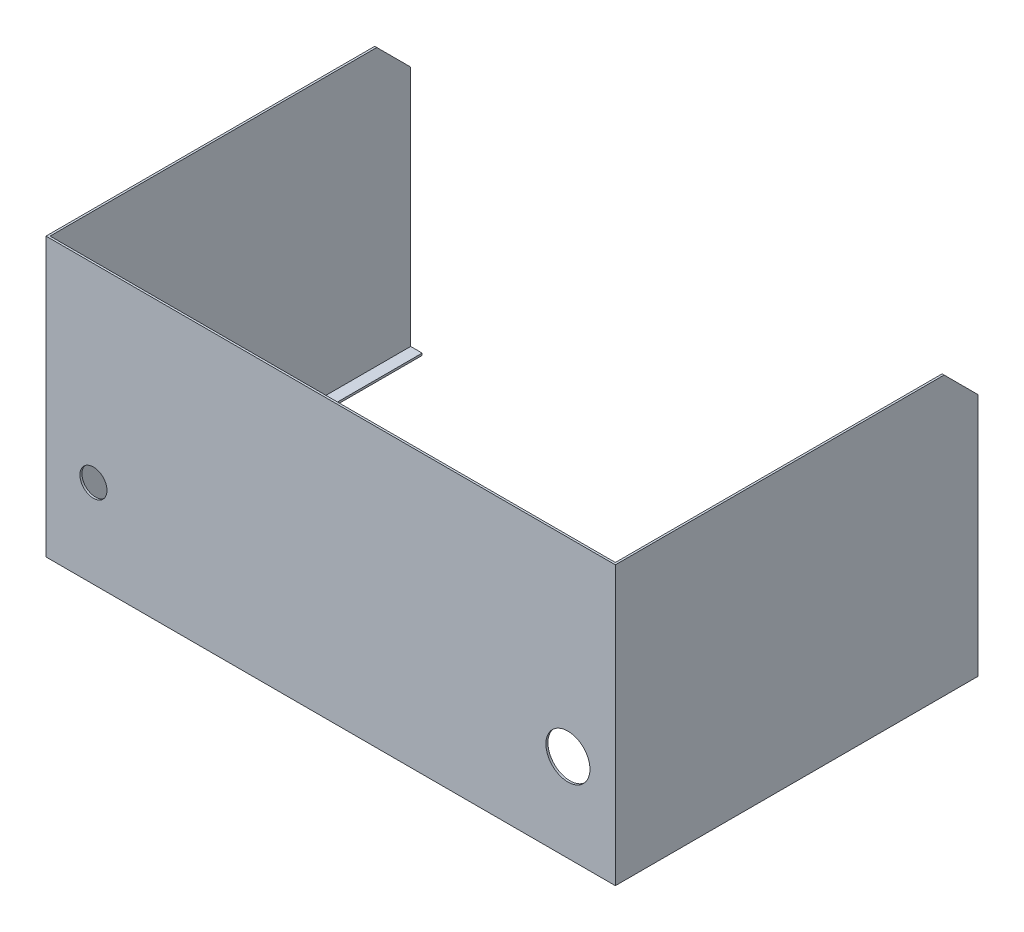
ISO-10303-21;
HEADER;
FILE_DESCRIPTION(('STEP AP214'),'2;1');
FILE_NAME('part.step','',(''),(''),'','','');
FILE_SCHEMA(('AUTOMOTIVE_DESIGN { 1 0 10303 214 1 1 1 1 }'));
ENDSEC;
DATA;
#1=APPLICATION_CONTEXT('core data for automotive mechanical design processes');
#2=APPLICATION_PROTOCOL_DEFINITION('international standard','automotive_design',2000,#1);
#3=PRODUCT_CONTEXT('',#1,'mechanical');
#4=PRODUCT('Part','Part','',(#3));
#5=PRODUCT_RELATED_PRODUCT_CATEGORY('part','',(#4));
#6=PRODUCT_DEFINITION_FORMATION('','',#4);
#7=PRODUCT_DEFINITION_CONTEXT('part definition',#1,'design');
#8=PRODUCT_DEFINITION('design','',#6,#7);
#9=PRODUCT_DEFINITION_SHAPE('','',#8);
#10=(LENGTH_UNIT() NAMED_UNIT(*) SI_UNIT(.MILLI.,.METRE.));
#11=(NAMED_UNIT(*) PLANE_ANGLE_UNIT() SI_UNIT($,.RADIAN.));
#12=(NAMED_UNIT(*) SI_UNIT($,.STERADIAN.) SOLID_ANGLE_UNIT());
#13=UNCERTAINTY_MEASURE_WITH_UNIT(LENGTH_MEASURE(1.E-05),#10,'distance_accuracy_value','');
#14=(GEOMETRIC_REPRESENTATION_CONTEXT(3) GLOBAL_UNCERTAINTY_ASSIGNED_CONTEXT((#13)) GLOBAL_UNIT_ASSIGNED_CONTEXT((#10,
#11,#12)) REPRESENTATION_CONTEXT('',''));
#15=CARTESIAN_POINT('',(0.,0.,0.));
#16=DIRECTION('',(0.,0.,1.));
#17=DIRECTION('',(1.,0.,0.));
#18=AXIS2_PLACEMENT_3D('',#15,#16,#17);
#19=CARTESIAN_POINT('',(417.,1.287136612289E-13,0.));
#20=DIRECTION('',(1.,0.,0.));
#21=DIRECTION('',(0.,1.,0.));
#22=AXIS2_PLACEMENT_3D('',#19,#20,#21);
#23=PLANE('',#22);
#24=DIRECTION('',(0.,0.,-1.));
#25=VECTOR('',#24,1.);
#26=CARTESIAN_POINT('',(417.,-202.,0.));
#27=LINE('',#26,#25);
#28=CARTESIAN_POINT('',(417.,-202.,0.));
#29=VERTEX_POINT('',#28);
#30=CARTESIAN_POINT('',(417.,-202.,-532.));
#31=VERTEX_POINT('',#30);
#32=EDGE_CURVE('E201',#29,#31,#27,.T.);
#33=ORIENTED_EDGE('',*,*,#32,.F.);
#34=DIRECTION('',(0.,-1.,0.));
#35=VECTOR('',#34,1.);
#36=CARTESIAN_POINT('',(417.,-205.,0.));
#37=LINE('',#36,#35);
#38=CARTESIAN_POINT('',(417.,205.,0.));
#39=VERTEX_POINT('',#38);
#40=EDGE_CURVE('E97',#39,#29,#37,.T.);
#41=ORIENTED_EDGE('',*,*,#40,.F.);
#42=DIRECTION('',(0.,0.,1.));
#43=VECTOR('',#42,1.);
#44=CARTESIAN_POINT('',(417.,205.,0.));
#45=LINE('',#44,#43);
#46=CARTESIAN_POINT('',(417.,205.,-482.));
#47=VERTEX_POINT('',#46);
#48=EDGE_CURVE('E103',#47,#39,#45,.T.);
#49=ORIENTED_EDGE('',*,*,#48,.F.);
#50=DIRECTION('',(0.,0.707106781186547,0.707106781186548));
#51=VECTOR('',#50,1.);
#52=CARTESIAN_POINT('',(417.,205.,-482.));
#53=LINE('',#52,#51);
#54=CARTESIAN_POINT('',(417.,155.,-532.));
#55=VERTEX_POINT('',#54);
#56=EDGE_CURVE('E76',#55,#47,#53,.T.);
#57=ORIENTED_EDGE('',*,*,#56,.F.);
#58=DIRECTION('',(0.,1.,0.));
#59=VECTOR('',#58,1.);
#60=CARTESIAN_POINT('',(417.,-205.,-532.));
#61=LINE('',#60,#59);
#62=EDGE_CURVE('E88',#31,#55,#61,.T.);
#63=ORIENTED_EDGE('',*,*,#62,.F.);
#64=EDGE_LOOP('',(#33,#41,#49,#57,#63));
#65=FACE_BOUND('',#64,.T.);
#66=ADVANCED_FACE('F37',(#65),#23,.F.);
#67=CARTESIAN_POINT('',(417.,-205.,0.));
#68=DIRECTION('',(0.,-1.,0.));
#69=DIRECTION('',(1.,0.,0.));
#70=AXIS2_PLACEMENT_3D('',#67,#68,#69);
#71=PLANE('',#70);
#72=DIRECTION('',(0.,0.,-1.));
#73=VECTOR('',#72,1.);
#74=CARTESIAN_POINT('',(420.,-205.,0.));
#75=LINE('',#74,#73);
#76=CARTESIAN_POINT('',(420.,-205.,3.));
#77=VERTEX_POINT('',#76);
#78=CARTESIAN_POINT('',(420.,-205.,-532.));
#79=VERTEX_POINT('',#78);
#80=EDGE_CURVE('E94',#77,#79,#75,.T.);
#81=ORIENTED_EDGE('',*,*,#80,.F.);
#82=DIRECTION('',(1.,0.,0.));
#83=VECTOR('',#82,1.);
#84=CARTESIAN_POINT('',(420.,-205.,3.));
#85=LINE('',#84,#83);
#86=CARTESIAN_POINT('',(-420.,-205.,3.));
#87=VERTEX_POINT('',#86);
#88=EDGE_CURVE('E221',#87,#77,#85,.T.);
#89=ORIENTED_EDGE('',*,*,#88,.F.);
#90=DIRECTION('',(0.,0.,-1.));
#91=VECTOR('',#90,1.);
#92=CARTESIAN_POINT('',(-420.,-205.,3.));
#93=LINE('',#92,#91);
#94=CARTESIAN_POINT('',(-420.,-205.,-532.));
#95=VERTEX_POINT('',#94);
#96=EDGE_CURVE('E193',#87,#95,#93,.T.);
#97=ORIENTED_EDGE('',*,*,#96,.T.);
#98=DIRECTION('',(1.,0.,0.));
#99=VECTOR('',#98,1.);
#100=CARTESIAN_POINT('',(0.,-205.,-532.));
#101=LINE('',#100,#99);
#102=CARTESIAN_POINT('',(-400.,-205.,-532.));
#103=VERTEX_POINT('',#102);
#104=EDGE_CURVE('E127',#95,#103,#101,.T.);
#105=ORIENTED_EDGE('',*,*,#104,.T.);
#106=DIRECTION('',(0.,0.,1.));
#107=VECTOR('',#106,1.);
#108=CARTESIAN_POINT('',(-400.,-205.,0.));
#109=LINE('',#108,#107);
#110=CARTESIAN_POINT('',(-400.,-205.,-17.));
#111=VERTEX_POINT('',#110);
#112=EDGE_CURVE('E189',#103,#111,#109,.T.);
#113=ORIENTED_EDGE('',*,*,#112,.T.);
#114=DIRECTION('',(1.,0.,0.));
#115=VECTOR('',#114,1.);
#116=CARTESIAN_POINT('',(0.,-205.,-17.));
#117=LINE('',#116,#115);
#118=CARTESIAN_POINT('',(400.,-205.,-17.));
#119=VERTEX_POINT('',#118);
#120=EDGE_CURVE('E186',#111,#119,#117,.T.);
#121=ORIENTED_EDGE('',*,*,#120,.T.);
#122=DIRECTION('',(0.,0.,1.));
#123=VECTOR('',#122,1.);
#124=CARTESIAN_POINT('',(400.,-205.,0.));
#125=LINE('',#124,#123);
#126=CARTESIAN_POINT('',(400.,-205.,-532.));
#127=VERTEX_POINT('',#126);
#128=EDGE_CURVE('E181',#127,#119,#125,.T.);
#129=ORIENTED_EDGE('',*,*,#128,.F.);
#130=DIRECTION('',(1.,0.,0.));
#131=VECTOR('',#130,1.);
#132=CARTESIAN_POINT('',(417.,-205.,-532.));
#133=LINE('',#132,#131);
#134=EDGE_CURVE('E41',#127,#79,#133,.T.);
#135=ORIENTED_EDGE('',*,*,#134,.T.);
#136=EDGE_LOOP('',(#81,#89,#97,#105,#113,#121,#129,#135));
#137=FACE_BOUND('',#136,.T.);
#138=ADVANCED_FACE('F39',(#137),#71,.T.);
#139=CARTESIAN_POINT('',(417.,205.,0.));
#140=DIRECTION('',(0.,1.,0.));
#141=DIRECTION('',(-1.,0.,0.));
#142=AXIS2_PLACEMENT_3D('',#139,#140,#141);
#143=PLANE('',#142);
#144=DIRECTION('',(0.,0.,1.));
#145=VECTOR('',#144,1.);
#146=CARTESIAN_POINT('',(420.,205.,0.));
#147=LINE('',#146,#145);
#148=CARTESIAN_POINT('',(420.,205.,-482.));
#149=VERTEX_POINT('',#148);
#150=CARTESIAN_POINT('',(420.,205.,3.));
#151=VERTEX_POINT('',#150);
#152=EDGE_CURVE('E79',#149,#151,#147,.T.);
#153=ORIENTED_EDGE('',*,*,#152,.F.);
#154=DIRECTION('',(1.,0.,0.));
#155=VECTOR('',#154,1.);
#156=CARTESIAN_POINT('',(417.,205.,-482.));
#157=LINE('',#156,#155);
#158=EDGE_CURVE('E11',#47,#149,#157,.T.);
#159=ORIENTED_EDGE('',*,*,#158,.F.);
#160=ORIENTED_EDGE('',*,*,#48,.T.);
#161=DIRECTION('',(-1.,0.,0.));
#162=VECTOR('',#161,1.);
#163=CARTESIAN_POINT('',(420.,205.,0.));
#164=LINE('',#163,#162);
#165=CARTESIAN_POINT('',(-417.,205.,0.));
#166=VERTEX_POINT('',#165);
#167=EDGE_CURVE('E149',#39,#166,#164,.T.);
#168=ORIENTED_EDGE('',*,*,#167,.T.);
#169=DIRECTION('',(0.,0.,-1.));
#170=VECTOR('',#169,1.);
#171=CARTESIAN_POINT('',(-417.,205.,0.));
#172=LINE('',#171,#170);
#173=CARTESIAN_POINT('',(-417.,205.,-482.));
#174=VERTEX_POINT('',#173);
#175=EDGE_CURVE('E253',#166,#174,#172,.T.);
#176=ORIENTED_EDGE('',*,*,#175,.T.);
#177=DIRECTION('',(-1.,0.,0.));
#178=VECTOR('',#177,1.);
#179=CARTESIAN_POINT('',(-417.,205.,-482.));
#180=LINE('',#179,#178);
#181=CARTESIAN_POINT('',(-420.,205.,-482.));
#182=VERTEX_POINT('',#181);
#183=EDGE_CURVE('E238',#174,#182,#180,.T.);
#184=ORIENTED_EDGE('',*,*,#183,.T.);
#185=DIRECTION('',(0.,0.,-1.));
#186=VECTOR('',#185,1.);
#187=CARTESIAN_POINT('',(-420.,205.,3.));
#188=LINE('',#187,#186);
#189=CARTESIAN_POINT('',(-420.,205.,3.));
#190=VERTEX_POINT('',#189);
#191=EDGE_CURVE('E212',#190,#182,#188,.T.);
#192=ORIENTED_EDGE('',*,*,#191,.F.);
#193=DIRECTION('',(-1.,0.,0.));
#194=VECTOR('',#193,1.);
#195=CARTESIAN_POINT('',(420.,205.,3.));
#196=LINE('',#195,#194);
#197=EDGE_CURVE('E84',#151,#190,#196,.T.);
#198=ORIENTED_EDGE('',*,*,#197,.F.);
#199=EDGE_LOOP('',(#153,#159,#160,#168,#176,#184,#192,#198));
#200=FACE_BOUND('',#199,.T.);
#201=ADVANCED_FACE('F80',(#200),#143,.T.);
#202=CARTESIAN_POINT('',(417.,205.,-482.));
#203=DIRECTION('',(0.,0.707106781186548,-0.707106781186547));
#204=DIRECTION('',(0.,0.707106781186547,0.707106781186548));
#205=AXIS2_PLACEMENT_3D('',#202,#203,#204);
#206=PLANE('',#205);
#207=DIRECTION('',(0.,0.707106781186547,0.707106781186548));
#208=VECTOR('',#207,1.);
#209=CARTESIAN_POINT('',(420.,205.,-482.));
#210=LINE('',#209,#208);
#211=CARTESIAN_POINT('',(420.,155.,-532.));
#212=VERTEX_POINT('',#211);
#213=EDGE_CURVE('E73',#212,#149,#210,.T.);
#214=ORIENTED_EDGE('',*,*,#213,.F.);
#215=DIRECTION('',(1.,0.,0.));
#216=VECTOR('',#215,1.);
#217=CARTESIAN_POINT('',(417.,155.,-532.));
#218=LINE('',#217,#216);
#219=EDGE_CURVE('E47',#55,#212,#218,.T.);
#220=ORIENTED_EDGE('',*,*,#219,.F.);
#221=ORIENTED_EDGE('',*,*,#56,.T.);
#222=ORIENTED_EDGE('',*,*,#158,.T.);
#223=EDGE_LOOP('',(#214,#220,#221,#222));
#224=FACE_BOUND('',#223,.T.);
#225=ADVANCED_FACE('F71',(#224),#206,.T.);
#226=CARTESIAN_POINT('',(417.,-205.,-532.));
#227=DIRECTION('',(0.,0.,-1.));
#228=DIRECTION('',(-1.,0.,0.));
#229=AXIS2_PLACEMENT_3D('',#226,#227,#228);
#230=PLANE('',#229);
#231=DIRECTION('',(0.,1.,0.));
#232=VECTOR('',#231,1.);
#233=CARTESIAN_POINT('',(420.,-205.,-532.));
#234=LINE('',#233,#232);
#235=EDGE_CURVE('E92',#79,#212,#234,.T.);
#236=ORIENTED_EDGE('',*,*,#235,.F.);
#237=ORIENTED_EDGE('',*,*,#134,.F.);
#238=DIRECTION('',(0.,-1.,0.));
#239=VECTOR('',#238,1.);
#240=CARTESIAN_POINT('',(400.,-202.,-532.));
#241=LINE('',#240,#239);
#242=CARTESIAN_POINT('',(400.,-202.,-532.));
#243=VERTEX_POINT('',#242);
#244=EDGE_CURVE('E115',#243,#127,#241,.T.);
#245=ORIENTED_EDGE('',*,*,#244,.F.);
#246=DIRECTION('',(-1.,0.,0.));
#247=VECTOR('',#246,1.);
#248=CARTESIAN_POINT('',(0.,-202.,-532.));
#249=LINE('',#248,#247);
#250=EDGE_CURVE('E142',#31,#243,#249,.T.);
#251=ORIENTED_EDGE('',*,*,#250,.F.);
#252=ORIENTED_EDGE('',*,*,#62,.T.);
#253=ORIENTED_EDGE('',*,*,#219,.T.);
#254=EDGE_LOOP('',(#236,#237,#245,#251,#252,#253));
#255=FACE_BOUND('',#254,.T.);
#256=ADVANCED_FACE('F138',(#255),#230,.T.);
#257=CARTESIAN_POINT('',(420.,1.29526019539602E-13,0.));
#258=DIRECTION('',(1.,0.,0.));
#259=DIRECTION('',(0.,1.,0.));
#260=AXIS2_PLACEMENT_3D('',#257,#258,#259);
#261=PLANE('',#260);
#262=ORIENTED_EDGE('',*,*,#80,.T.);
#263=ORIENTED_EDGE('',*,*,#235,.T.);
#264=ORIENTED_EDGE('',*,*,#213,.T.);
#265=ORIENTED_EDGE('',*,*,#152,.T.);
#266=DIRECTION('',(0.,1.,0.));
#267=VECTOR('',#266,1.);
#268=CARTESIAN_POINT('',(420.,205.,3.));
#269=LINE('',#268,#267);
#270=EDGE_CURVE('E219',#77,#151,#269,.T.);
#271=ORIENTED_EDGE('',*,*,#270,.F.);
#272=EDGE_LOOP('',(#262,#263,#264,#265,#271));
#273=FACE_BOUND('',#272,.T.);
#274=ADVANCED_FACE('F91',(#273),#261,.T.);
#275=CARTESIAN_POINT('',(-400.,-202.,0.));
#276=DIRECTION('',(1.,0.,0.));
#277=DIRECTION('',(0.,1.,0.));
#278=AXIS2_PLACEMENT_3D('',#275,#276,#277);
#279=PLANE('',#278);
#280=ORIENTED_EDGE('',*,*,#112,.F.);
#281=DIRECTION('',(0.,-1.,0.));
#282=VECTOR('',#281,1.);
#283=CARTESIAN_POINT('',(-400.,-202.,-532.));
#284=LINE('',#283,#282);
#285=CARTESIAN_POINT('',(-400.,-202.,-532.));
#286=VERTEX_POINT('',#285);
#287=EDGE_CURVE('E113',#286,#103,#284,.T.);
#288=ORIENTED_EDGE('',*,*,#287,.F.);
#289=DIRECTION('',(0.,0.,1.));
#290=VECTOR('',#289,1.);
#291=CARTESIAN_POINT('',(-400.,-202.,0.));
#292=LINE('',#291,#290);
#293=CARTESIAN_POINT('',(-400.,-202.,-17.));
#294=VERTEX_POINT('',#293);
#295=EDGE_CURVE('E188',#286,#294,#292,.T.);
#296=ORIENTED_EDGE('',*,*,#295,.T.);
#297=DIRECTION('',(0.,-1.,0.));
#298=VECTOR('',#297,1.);
#299=CARTESIAN_POINT('',(-400.,-202.,-17.));
#300=LINE('',#299,#298);
#301=EDGE_CURVE('E132',#294,#111,#300,.T.);
#302=ORIENTED_EDGE('',*,*,#301,.T.);
#303=EDGE_LOOP('',(#280,#288,#296,#302));
#304=FACE_BOUND('',#303,.T.);
#305=ADVANCED_FACE('F271',(#304),#279,.T.);
#306=CARTESIAN_POINT('',(0.,-202.,-532.));
#307=DIRECTION('',(0.,0.,-1.));
#308=DIRECTION('',(-1.,0.,0.));
#309=AXIS2_PLACEMENT_3D('',#306,#307,#308);
#310=PLANE('',#309);
#311=ORIENTED_EDGE('',*,*,#104,.F.);
#312=DIRECTION('',(0.,-1.,0.));
#313=VECTOR('',#312,1.);
#314=CARTESIAN_POINT('',(-420.,155.,-532.));
#315=LINE('',#314,#313);
#316=CARTESIAN_POINT('',(-420.,155.,-532.));
#317=VERTEX_POINT('',#316);
#318=EDGE_CURVE('E248',#317,#95,#315,.T.);
#319=ORIENTED_EDGE('',*,*,#318,.F.);
#320=DIRECTION('',(-1.,0.,0.));
#321=VECTOR('',#320,1.);
#322=CARTESIAN_POINT('',(-417.,155.,-532.));
#323=LINE('',#322,#321);
#324=CARTESIAN_POINT('',(-417.,155.,-532.));
#325=VERTEX_POINT('',#324);
#326=EDGE_CURVE('E235',#325,#317,#323,.T.);
#327=ORIENTED_EDGE('',*,*,#326,.F.);
#328=DIRECTION('',(0.,-1.,0.));
#329=VECTOR('',#328,1.);
#330=CARTESIAN_POINT('',(-417.,155.,-532.));
#331=LINE('',#330,#329);
#332=CARTESIAN_POINT('',(-417.,-202.,-532.));
#333=VERTEX_POINT('',#332);
#334=EDGE_CURVE('E247',#325,#333,#331,.T.);
#335=ORIENTED_EDGE('',*,*,#334,.T.);
#336=DIRECTION('',(1.,0.,0.));
#337=VECTOR('',#336,1.);
#338=CARTESIAN_POINT('',(0.,-202.,-532.));
#339=LINE('',#338,#337);
#340=EDGE_CURVE('E135',#333,#286,#339,.T.);
#341=ORIENTED_EDGE('',*,*,#340,.T.);
#342=ORIENTED_EDGE('',*,*,#287,.T.);
#343=EDGE_LOOP('',(#311,#319,#327,#335,#341,#342));
#344=FACE_BOUND('',#343,.T.);
#345=ADVANCED_FACE('F261',(#344),#310,.T.);
#346=CARTESIAN_POINT('',(400.,-202.,0.));
#347=DIRECTION('',(1.,0.,0.));
#348=DIRECTION('',(0.,1.,0.));
#349=AXIS2_PLACEMENT_3D('',#346,#347,#348);
#350=PLANE('',#349);
#351=ORIENTED_EDGE('',*,*,#128,.T.);
#352=DIRECTION('',(0.,-1.,0.));
#353=VECTOR('',#352,1.);
#354=CARTESIAN_POINT('',(400.,-202.,-17.));
#355=LINE('',#354,#353);
#356=CARTESIAN_POINT('',(400.,-202.,-17.));
#357=VERTEX_POINT('',#356);
#358=EDGE_CURVE('E124',#357,#119,#355,.T.);
#359=ORIENTED_EDGE('',*,*,#358,.F.);
#360=DIRECTION('',(0.,0.,1.));
#361=VECTOR('',#360,1.);
#362=CARTESIAN_POINT('',(400.,-202.,0.));
#363=LINE('',#362,#361);
#364=EDGE_CURVE('E183',#243,#357,#363,.T.);
#365=ORIENTED_EDGE('',*,*,#364,.F.);
#366=ORIENTED_EDGE('',*,*,#244,.T.);
#367=EDGE_LOOP('',(#351,#359,#365,#366));
#368=FACE_BOUND('',#367,.T.);
#369=ADVANCED_FACE('F179',(#368),#350,.F.);
#370=CARTESIAN_POINT('',(0.,-202.,-17.));
#371=DIRECTION('',(0.,0.,-1.));
#372=DIRECTION('',(-1.,0.,0.));
#373=AXIS2_PLACEMENT_3D('',#370,#371,#372);
#374=PLANE('',#373);
#375=ORIENTED_EDGE('',*,*,#120,.F.);
#376=ORIENTED_EDGE('',*,*,#301,.F.);
#377=DIRECTION('',(1.,0.,0.));
#378=VECTOR('',#377,1.);
#379=CARTESIAN_POINT('',(0.,-202.,-17.));
#380=LINE('',#379,#378);
#381=EDGE_CURVE('E205',#294,#357,#380,.T.);
#382=ORIENTED_EDGE('',*,*,#381,.T.);
#383=ORIENTED_EDGE('',*,*,#358,.T.);
#384=EDGE_LOOP('',(#375,#376,#382,#383));
#385=FACE_BOUND('',#384,.T.);
#386=ADVANCED_FACE('F304',(#385),#374,.T.);
#387=CARTESIAN_POINT('',(0.,-202.,0.));
#388=DIRECTION('',(0.,-1.,0.));
#389=DIRECTION('',(1.,0.,0.));
#390=AXIS2_PLACEMENT_3D('',#387,#388,#389);
#391=PLANE('',#390);
#392=ORIENTED_EDGE('',*,*,#295,.F.);
#393=ORIENTED_EDGE('',*,*,#340,.F.);
#394=DIRECTION('',(0.,0.,1.));
#395=VECTOR('',#394,1.);
#396=CARTESIAN_POINT('',(-417.,-202.,0.));
#397=LINE('',#396,#395);
#398=CARTESIAN_POINT('',(-417.,-202.,0.));
#399=VERTEX_POINT('',#398);
#400=EDGE_CURVE('E195',#333,#399,#397,.T.);
#401=ORIENTED_EDGE('',*,*,#400,.T.);
#402=DIRECTION('',(1.,0.,0.));
#403=VECTOR('',#402,1.);
#404=CARTESIAN_POINT('',(0.,-202.,0.));
#405=LINE('',#404,#403);
#406=EDGE_CURVE('E198',#399,#29,#405,.T.);
#407=ORIENTED_EDGE('',*,*,#406,.T.);
#408=ORIENTED_EDGE('',*,*,#32,.T.);
#409=ORIENTED_EDGE('',*,*,#250,.T.);
#410=ORIENTED_EDGE('',*,*,#364,.T.);
#411=ORIENTED_EDGE('',*,*,#381,.F.);
#412=EDGE_LOOP('',(#392,#393,#401,#407,#408,#409,#410,#411));
#413=FACE_BOUND('',#412,.T.);
#414=ADVANCED_FACE('F268',(#413),#391,.F.);
#415=CARTESIAN_POINT('',(0.,0.,0.));
#416=DIRECTION('',(0.,0.,-1.));
#417=DIRECTION('',(-1.,0.,0.));
#418=AXIS2_PLACEMENT_3D('',#415,#416,#417);
#419=PLANE('',#418);
#420=CARTESIAN_POINT('',(350.,-74.9999999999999,0.));
#421=DIRECTION('',(0.,0.,1.));
#422=DIRECTION('',(1.,0.,0.));
#423=AXIS2_PLACEMENT_3D('',#420,#421,#422);
#424=CIRCLE('',#423,32.5);
#425=CARTESIAN_POINT('',(382.5,-74.9999999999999,0.));
#426=VERTEX_POINT('',#425);
#427=EDGE_CURVE('E232',#426,#426,#424,.T.);
#428=ORIENTED_EDGE('',*,*,#427,.T.);
#429=EDGE_LOOP('',(#428));
#430=FACE_BOUND('',#429,.T.);
#431=CARTESIAN_POINT('',(-350.,-75.,0.));
#432=DIRECTION('',(0.,0.,1.));
#433=DIRECTION('',(1.,0.,0.));
#434=AXIS2_PLACEMENT_3D('',#431,#432,#433);
#435=CIRCLE('',#434,20.);
#436=CARTESIAN_POINT('',(-330.,-75.,0.));
#437=VERTEX_POINT('',#436);
#438=EDGE_CURVE('E226',#437,#437,#435,.T.);
#439=ORIENTED_EDGE('',*,*,#438,.T.);
#440=EDGE_LOOP('',(#439));
#441=FACE_BOUND('',#440,.T.);
#442=ORIENTED_EDGE('',*,*,#40,.T.);
#443=ORIENTED_EDGE('',*,*,#406,.F.);
#444=DIRECTION('',(0.,1.,0.));
#445=VECTOR('',#444,1.);
#446=CARTESIAN_POINT('',(-417.,-205.,0.));
#447=LINE('',#446,#445);
#448=EDGE_CURVE('E255',#399,#166,#447,.T.);
#449=ORIENTED_EDGE('',*,*,#448,.T.);
#450=ORIENTED_EDGE('',*,*,#167,.F.);
#451=EDGE_LOOP('',(#442,#443,#449,#450));
#452=FACE_BOUND('',#451,.T.);
#453=ADVANCED_FACE('F302',(#430,#441,#452),#419,.T.);
#454=CARTESIAN_POINT('',(-417.,0.,0.));
#455=DIRECTION('',(-1.,0.,0.));
#456=DIRECTION('',(0.,0.,1.));
#457=AXIS2_PLACEMENT_3D('',#454,#455,#456);
#458=PLANE('',#457);
#459=ORIENTED_EDGE('',*,*,#448,.F.);
#460=ORIENTED_EDGE('',*,*,#400,.F.);
#461=ORIENTED_EDGE('',*,*,#334,.F.);
#462=DIRECTION('',(0.,-0.707106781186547,-0.707106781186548));
#463=VECTOR('',#462,1.);
#464=CARTESIAN_POINT('',(-417.,205.,-482.));
#465=LINE('',#464,#463);
#466=EDGE_CURVE('E241',#174,#325,#465,.T.);
#467=ORIENTED_EDGE('',*,*,#466,.F.);
#468=ORIENTED_EDGE('',*,*,#175,.F.);
#469=EDGE_LOOP('',(#459,#460,#461,#467,#468));
#470=FACE_BOUND('',#469,.T.);
#471=ADVANCED_FACE('F301',(#470),#458,.F.);
#472=CARTESIAN_POINT('',(0.,0.,3.));
#473=DIRECTION('',(0.,0.,-1.));
#474=DIRECTION('',(-1.,0.,0.));
#475=AXIS2_PLACEMENT_3D('',#472,#473,#474);
#476=PLANE('',#475);
#477=DIRECTION('',(0.,-1.,0.));
#478=VECTOR('',#477,1.);
#479=CARTESIAN_POINT('',(-420.,205.,3.));
#480=LINE('',#479,#478);
#481=EDGE_CURVE('E216',#190,#87,#480,.T.);
#482=ORIENTED_EDGE('',*,*,#481,.T.);
#483=ORIENTED_EDGE('',*,*,#88,.T.);
#484=ORIENTED_EDGE('',*,*,#270,.T.);
#485=ORIENTED_EDGE('',*,*,#197,.T.);
#486=EDGE_LOOP('',(#482,#483,#484,#485));
#487=FACE_BOUND('',#486,.T.);
#488=CARTESIAN_POINT('',(-350.,-75.,3.));
#489=DIRECTION('',(0.,0.,1.));
#490=DIRECTION('',(1.,0.,0.));
#491=AXIS2_PLACEMENT_3D('',#488,#489,#490);
#492=CIRCLE('',#491,20.);
#493=CARTESIAN_POINT('',(-330.,-75.,3.));
#494=VERTEX_POINT('',#493);
#495=EDGE_CURVE('E217',#494,#494,#492,.T.);
#496=ORIENTED_EDGE('',*,*,#495,.F.);
#497=EDGE_LOOP('',(#496));
#498=FACE_BOUND('',#497,.T.);
#499=CARTESIAN_POINT('',(350.,-74.9999999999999,3.));
#500=DIRECTION('',(0.,0.,1.));
#501=DIRECTION('',(1.,0.,0.));
#502=AXIS2_PLACEMENT_3D('',#499,#500,#501);
#503=CIRCLE('',#502,32.5);
#504=CARTESIAN_POINT('',(382.5,-74.9999999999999,3.));
#505=VERTEX_POINT('',#504);
#506=EDGE_CURVE('E229',#505,#505,#503,.T.);
#507=ORIENTED_EDGE('',*,*,#506,.F.);
#508=EDGE_LOOP('',(#507));
#509=FACE_BOUND('',#508,.T.);
#510=ADVANCED_FACE('F291',(#487,#498,#509),#476,.F.);
#511=CARTESIAN_POINT('',(-420.,205.,3.));
#512=DIRECTION('',(1.,0.,0.));
#513=DIRECTION('',(0.,1.,0.));
#514=AXIS2_PLACEMENT_3D('',#511,#512,#513);
#515=PLANE('',#514);
#516=ORIENTED_EDGE('',*,*,#191,.T.);
#517=DIRECTION('',(0.,-0.707106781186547,-0.707106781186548));
#518=VECTOR('',#517,1.);
#519=CARTESIAN_POINT('',(-420.,205.,-482.));
#520=LINE('',#519,#518);
#521=EDGE_CURVE('E244',#182,#317,#520,.T.);
#522=ORIENTED_EDGE('',*,*,#521,.T.);
#523=ORIENTED_EDGE('',*,*,#318,.T.);
#524=ORIENTED_EDGE('',*,*,#96,.F.);
#525=ORIENTED_EDGE('',*,*,#481,.F.);
#526=EDGE_LOOP('',(#516,#522,#523,#524,#525));
#527=FACE_BOUND('',#526,.T.);
#528=ADVANCED_FACE('F297',(#527),#515,.F.);
#529=CARTESIAN_POINT('',(-350.,-75.,3.));
#530=DIRECTION('',(0.,0.,-1.));
#531=DIRECTION('',(-1.,0.,0.));
#532=AXIS2_PLACEMENT_3D('',#529,#530,#531);
#533=CYLINDRICAL_SURFACE('',#532,20.);
#534=ORIENTED_EDGE('',*,*,#495,.T.);
#535=EDGE_LOOP('',(#534));
#536=FACE_BOUND('',#535,.T.);
#537=ORIENTED_EDGE('',*,*,#438,.F.);
#538=EDGE_LOOP('',(#537));
#539=FACE_BOUND('',#538,.T.);
#540=ADVANCED_FACE('F386',(#536,#539),#533,.F.);
#541=CARTESIAN_POINT('',(350.,-74.9999999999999,3.));
#542=DIRECTION('',(0.,0.,-1.));
#543=DIRECTION('',(-1.,0.,0.));
#544=AXIS2_PLACEMENT_3D('',#541,#542,#543);
#545=CYLINDRICAL_SURFACE('',#544,32.5);
#546=ORIENTED_EDGE('',*,*,#506,.T.);
#547=EDGE_LOOP('',(#546));
#548=FACE_BOUND('',#547,.T.);
#549=ORIENTED_EDGE('',*,*,#427,.F.);
#550=EDGE_LOOP('',(#549));
#551=FACE_BOUND('',#550,.T.);
#552=ADVANCED_FACE('F394',(#548,#551),#545,.F.);
#553=CARTESIAN_POINT('',(-417.,205.,-482.));
#554=DIRECTION('',(0.,0.707106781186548,-0.707106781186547));
#555=DIRECTION('',(0.,0.707106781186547,0.707106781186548));
#556=AXIS2_PLACEMENT_3D('',#553,#554,#555);
#557=PLANE('',#556);
#558=ORIENTED_EDGE('',*,*,#521,.F.);
#559=ORIENTED_EDGE('',*,*,#183,.F.);
#560=ORIENTED_EDGE('',*,*,#466,.T.);
#561=ORIENTED_EDGE('',*,*,#326,.T.);
#562=EDGE_LOOP('',(#558,#559,#560,#561));
#563=FACE_BOUND('',#562,.T.);
#564=ADVANCED_FACE('F299',(#563),#557,.T.);
#565=CLOSED_SHELL('',(#66,#138,#201,#225,#256,#274,#305,#345,#369,#386,#414,#453,#471,#510,#528,
#540,#552,#564));
#566=MANIFOLD_SOLID_BREP('B2',#565);
#567=ADVANCED_BREP_SHAPE_REPRESENTATION('',(#18,#566),#14);
#568=SHAPE_DEFINITION_REPRESENTATION(#9,#567);
ENDSEC;
END-ISO-10303-21;
